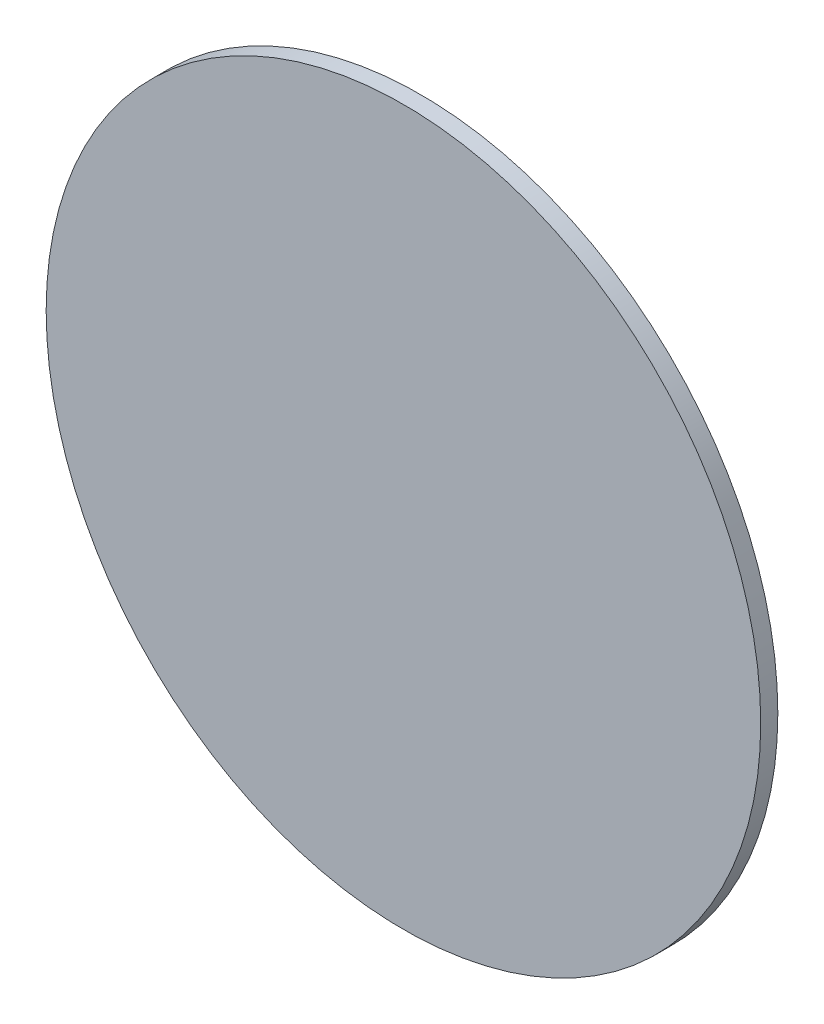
ISO-10303-21;
HEADER;
FILE_DESCRIPTION(('STEP AP214'),'2;1');
FILE_NAME('part.step','',(''),(''),'','','');
FILE_SCHEMA(('AUTOMOTIVE_DESIGN { 1 0 10303 214 1 1 1 1 }'));
ENDSEC;
DATA;
#1=APPLICATION_CONTEXT('core data for automotive mechanical design processes');
#2=APPLICATION_PROTOCOL_DEFINITION('international standard','automotive_design',2000,#1);
#3=PRODUCT_CONTEXT('',#1,'mechanical');
#4=PRODUCT('Part','Part','',(#3));
#5=PRODUCT_RELATED_PRODUCT_CATEGORY('part','',(#4));
#6=PRODUCT_DEFINITION_FORMATION('','',#4);
#7=PRODUCT_DEFINITION_CONTEXT('part definition',#1,'design');
#8=PRODUCT_DEFINITION('design','',#6,#7);
#9=PRODUCT_DEFINITION_SHAPE('','',#8);
#10=(LENGTH_UNIT() NAMED_UNIT(*) SI_UNIT(.MILLI.,.METRE.));
#11=(NAMED_UNIT(*) PLANE_ANGLE_UNIT() SI_UNIT($,.RADIAN.));
#12=(NAMED_UNIT(*) SI_UNIT($,.STERADIAN.) SOLID_ANGLE_UNIT());
#13=UNCERTAINTY_MEASURE_WITH_UNIT(LENGTH_MEASURE(1.E-05),#10,'distance_accuracy_value','');
#14=(GEOMETRIC_REPRESENTATION_CONTEXT(3) GLOBAL_UNCERTAINTY_ASSIGNED_CONTEXT((#13)) GLOBAL_UNIT_ASSIGNED_CONTEXT((#10,
#11,#12)) REPRESENTATION_CONTEXT('',''));
#15=CARTESIAN_POINT('',(0.,0.,0.));
#16=DIRECTION('',(0.,0.,1.));
#17=DIRECTION('',(1.,0.,0.));
#18=AXIS2_PLACEMENT_3D('',#15,#16,#17);
#19=CARTESIAN_POINT('',(0.,0.,0.5));
#20=DIRECTION('',(0.,0.,-1.));
#21=DIRECTION('',(-1.,0.,0.));
#22=AXIS2_PLACEMENT_3D('',#19,#20,#21);
#23=CYLINDRICAL_SURFACE('',#22,10.45);
#24=CARTESIAN_POINT('',(0.,0.,0.5));
#25=DIRECTION('',(0.,0.,1.));
#26=DIRECTION('',(1.,0.,0.));
#27=AXIS2_PLACEMENT_3D('',#24,#25,#26);
#28=CIRCLE('',#27,10.45);
#29=CARTESIAN_POINT('',(10.45,0.,0.5));
#30=VERTEX_POINT('',#29);
#31=EDGE_CURVE('E10',#30,#30,#28,.T.);
#32=ORIENTED_EDGE('',*,*,#31,.F.);
#33=EDGE_LOOP('',(#32));
#34=FACE_BOUND('',#33,.T.);
#35=CARTESIAN_POINT('',(0.,0.,0.));
#36=DIRECTION('',(0.,0.,1.));
#37=DIRECTION('',(1.,0.,0.));
#38=AXIS2_PLACEMENT_3D('',#35,#36,#37);
#39=CIRCLE('',#38,10.45);
#40=CARTESIAN_POINT('',(10.45,0.,0.));
#41=VERTEX_POINT('',#40);
#42=EDGE_CURVE('E42',#41,#41,#39,.T.);
#43=ORIENTED_EDGE('',*,*,#42,.T.);
#44=EDGE_LOOP('',(#43));
#45=FACE_BOUND('',#44,.T.);
#46=ADVANCED_FACE('F41',(#34,#45),#23,.T.);
#47=CARTESIAN_POINT('',(0.,0.,0.5));
#48=DIRECTION('',(0.,0.,1.));
#49=DIRECTION('',(1.,0.,0.));
#50=AXIS2_PLACEMENT_3D('',#47,#48,#49);
#51=PLANE('',#50);
#52=ORIENTED_EDGE('',*,*,#31,.T.);
#53=EDGE_LOOP('',(#52));
#54=FACE_BOUND('',#53,.T.);
#55=ADVANCED_FACE('F57',(#54),#51,.T.);
#56=CARTESIAN_POINT('',(0.,0.,0.));
#57=DIRECTION('',(0.,0.,1.));
#58=DIRECTION('',(1.,0.,0.));
#59=AXIS2_PLACEMENT_3D('',#56,#57,#58);
#60=PLANE('',#59);
#61=ORIENTED_EDGE('',*,*,#42,.F.);
#62=EDGE_LOOP('',(#61));
#63=FACE_BOUND('',#62,.T.);
#64=ADVANCED_FACE('F53',(#63),#60,.F.);
#65=CLOSED_SHELL('',(#46,#55,#64));
#66=MANIFOLD_SOLID_BREP('B2',#65);
#67=ADVANCED_BREP_SHAPE_REPRESENTATION('',(#18,#66),#14);
#68=SHAPE_DEFINITION_REPRESENTATION(#9,#67);
ENDSEC;
END-ISO-10303-21;
